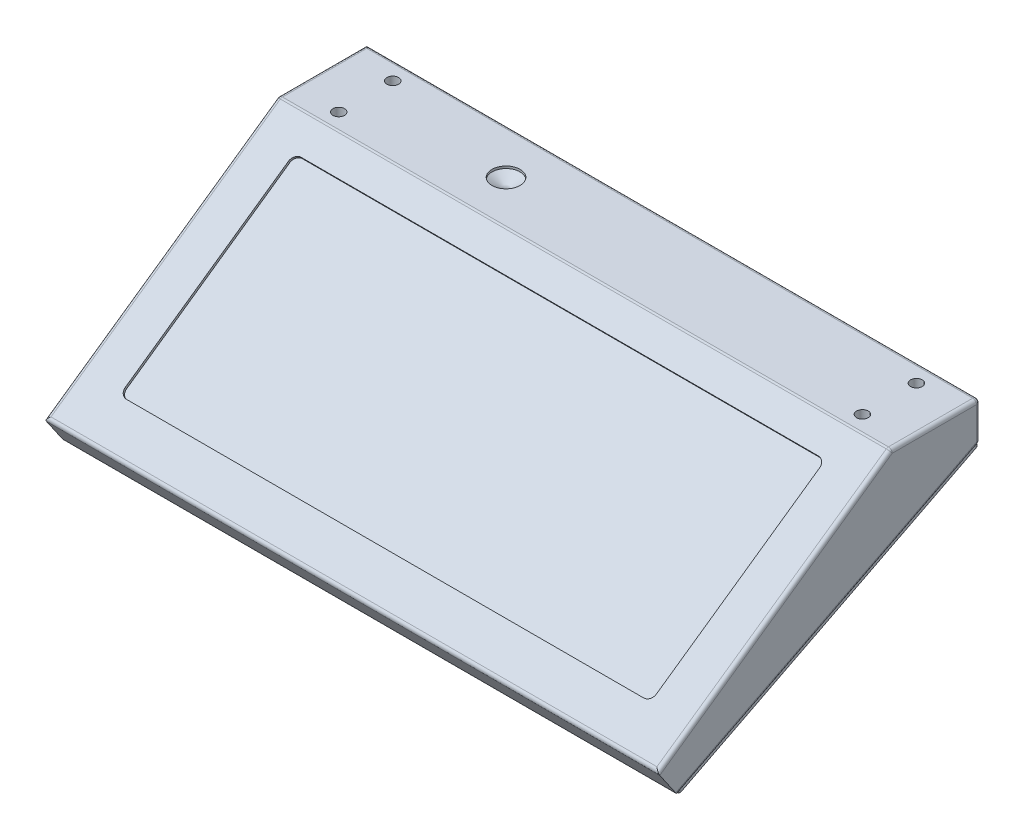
ISO-10303-21;
HEADER;
FILE_DESCRIPTION(('STEP AP214'),'2;1');
FILE_NAME('part.step','',(''),(''),'','','');
FILE_SCHEMA(('AUTOMOTIVE_DESIGN { 1 0 10303 214 1 1 1 1 }'));
ENDSEC;
DATA;
#1=APPLICATION_CONTEXT('core data for automotive mechanical design processes');
#2=APPLICATION_PROTOCOL_DEFINITION('international standard','automotive_design',2000,#1);
#3=PRODUCT_CONTEXT('',#1,'mechanical');
#4=PRODUCT('Part','Part','',(#3));
#5=PRODUCT_RELATED_PRODUCT_CATEGORY('part','',(#4));
#6=PRODUCT_DEFINITION_FORMATION('','',#4);
#7=PRODUCT_DEFINITION_CONTEXT('part definition',#1,'design');
#8=PRODUCT_DEFINITION('design','',#6,#7);
#9=PRODUCT_DEFINITION_SHAPE('','',#8);
#10=(LENGTH_UNIT() NAMED_UNIT(*) SI_UNIT(.MILLI.,.METRE.));
#11=(NAMED_UNIT(*) PLANE_ANGLE_UNIT() SI_UNIT($,.RADIAN.));
#12=(NAMED_UNIT(*) SI_UNIT($,.STERADIAN.) SOLID_ANGLE_UNIT());
#13=UNCERTAINTY_MEASURE_WITH_UNIT(LENGTH_MEASURE(1.E-05),#10,'distance_accuracy_value','');
#14=(GEOMETRIC_REPRESENTATION_CONTEXT(3) GLOBAL_UNCERTAINTY_ASSIGNED_CONTEXT((#13)) GLOBAL_UNIT_ASSIGNED_CONTEXT((#10,
#11,#12)) REPRESENTATION_CONTEXT('',''));
#15=CARTESIAN_POINT('',(0.,0.,0.));
#16=DIRECTION('',(0.,0.,1.));
#17=DIRECTION('',(1.,0.,0.));
#18=AXIS2_PLACEMENT_3D('',#15,#16,#17);
#19=CARTESIAN_POINT('',(208.28,0.,0.));
#20=DIRECTION('',(0.,0.,1.));
#21=DIRECTION('',(1.,0.,0.));
#22=AXIS2_PLACEMENT_3D('',#19,#20,#21);
#23=PLANE('',#22);
#24=DIRECTION('',(0.,1.,0.));
#25=VECTOR('',#24,1.);
#26=CARTESIAN_POINT('',(-208.28,0.,0.));
#27=LINE('',#26,#25);
#28=CARTESIAN_POINT('',(-208.28,-23.3112913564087,0.));
#29=VERTEX_POINT('',#28);
#30=CARTESIAN_POINT('',(-208.28,-2.54,0.));
#31=VERTEX_POINT('',#30);
#32=EDGE_CURVE('E394',#29,#31,#27,.T.);
#33=ORIENTED_EDGE('',*,*,#32,.T.);
#34=DIRECTION('',(-1.,0.,0.));
#35=VECTOR('',#34,1.);
#36=CARTESIAN_POINT('',(208.28,-2.54,0.));
#37=LINE('',#36,#35);
#38=CARTESIAN_POINT('',(205.74,-2.54,0.));
#39=VERTEX_POINT('',#38);
#40=EDGE_CURVE('E450',#31,#39,#37,.F.);
#41=ORIENTED_EDGE('',*,*,#40,.T.);
#42=DIRECTION('',(0.,1.,0.));
#43=VECTOR('',#42,1.);
#44=CARTESIAN_POINT('',(205.74,0.,0.));
#45=LINE('',#44,#43);
#46=CARTESIAN_POINT('',(205.74,-24.6054859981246,0.));
#47=VERTEX_POINT('',#46);
#48=EDGE_CURVE('E448',#39,#47,#45,.F.);
#49=ORIENTED_EDGE('',*,*,#48,.T.);
#50=DIRECTION('',(-1.,0.,0.));
#51=VECTOR('',#50,1.);
#52=CARTESIAN_POINT('',(208.28,-24.6054859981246,0.));
#53=LINE('',#52,#51);
#54=CARTESIAN_POINT('',(-208.003156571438,-24.6054859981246,0.));
#55=VERTEX_POINT('',#54);
#56=EDGE_CURVE('E444',#47,#55,#53,.T.);
#57=ORIENTED_EDGE('',*,*,#56,.T.);
#58=CARTESIAN_POINT('',(-205.74,-23.3112913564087,0.));
#59=DIRECTION('',(0.,0.,1.));
#60=DIRECTION('',(0.,-1.,0.));
#61=AXIS2_PLACEMENT_3D('',#58,#59,#60);
#62=ELLIPSE('',#61,2.85070864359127,2.54);
#63=EDGE_CURVE('E446',#55,#29,#62,.F.);
#64=ORIENTED_EDGE('',*,*,#63,.T.);
#65=EDGE_LOOP('',(#33,#41,#49,#57,#64));
#66=FACE_BOUND('',#65,.T.);
#67=ADVANCED_FACE('F33',(#66),#23,.F.);
#68=CARTESIAN_POINT('',(208.28,0.,0.));
#69=DIRECTION('',(0.,-1.,0.));
#70=DIRECTION('',(0.,0.,-1.));
#71=AXIS2_PLACEMENT_3D('',#68,#69,#70);
#72=PLANE('',#71);
#73=CARTESIAN_POINT('',(-82.55,0.,31.1590705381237));
#74=DIRECTION('',(0.,1.,0.));
#75=DIRECTION('',(0.,0.,1.));
#76=AXIS2_PLACEMENT_3D('',#73,#74,#75);
#77=CIRCLE('',#76,9.52500000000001);
#78=CARTESIAN_POINT('',(-82.55,0.,40.6840705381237));
#79=VERTEX_POINT('',#78);
#80=EDGE_CURVE('E247',#79,#79,#77,.T.);
#81=ORIENTED_EDGE('',*,*,#80,.F.);
#82=EDGE_LOOP('',(#81));
#83=FACE_BOUND('',#82,.T.);
#84=CARTESIAN_POINT('',(-177.8,0.,12.8202705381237));
#85=DIRECTION('',(0.,1.,0.));
#86=DIRECTION('',(0.,0.,1.));
#87=AXIS2_PLACEMENT_3D('',#84,#85,#86);
#88=CIRCLE('',#87,3.96874999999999);
#89=CARTESIAN_POINT('',(-177.8,0.,16.7890205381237));
#90=VERTEX_POINT('',#89);
#91=EDGE_CURVE('E246',#90,#90,#88,.T.);
#92=ORIENTED_EDGE('',*,*,#91,.F.);
#93=EDGE_LOOP('',(#92));
#94=FACE_BOUND('',#93,.T.);
#95=CARTESIAN_POINT('',(-177.8,0.,49.4978705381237));
#96=DIRECTION('',(0.,1.,0.));
#97=DIRECTION('',(0.,0.,1.));
#98=AXIS2_PLACEMENT_3D('',#95,#96,#97);
#99=CIRCLE('',#98,3.96874999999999);
#100=CARTESIAN_POINT('',(-177.8,0.,53.4666205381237));
#101=VERTEX_POINT('',#100);
#102=EDGE_CURVE('E254',#101,#101,#99,.T.);
#103=ORIENTED_EDGE('',*,*,#102,.F.);
#104=EDGE_LOOP('',(#103));
#105=FACE_BOUND('',#104,.T.);
#106=CARTESIAN_POINT('',(177.8,0.,49.4978705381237));
#107=DIRECTION('',(0.,1.,0.));
#108=DIRECTION('',(0.,0.,1.));
#109=AXIS2_PLACEMENT_3D('',#106,#107,#108);
#110=CIRCLE('',#109,3.96874999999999);
#111=CARTESIAN_POINT('',(177.8,0.,53.4666205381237));
#112=VERTEX_POINT('',#111);
#113=EDGE_CURVE('E260',#112,#112,#110,.T.);
#114=ORIENTED_EDGE('',*,*,#113,.F.);
#115=EDGE_LOOP('',(#114));
#116=FACE_BOUND('',#115,.T.);
#117=CARTESIAN_POINT('',(177.8,0.,12.8202705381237));
#118=DIRECTION('',(0.,1.,0.));
#119=DIRECTION('',(0.,0.,1.));
#120=AXIS2_PLACEMENT_3D('',#117,#118,#119);
#121=CIRCLE('',#120,3.96874999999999);
#122=CARTESIAN_POINT('',(177.8,0.,16.7890205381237));
#123=VERTEX_POINT('',#122);
#124=EDGE_CURVE('E264',#123,#123,#121,.T.);
#125=ORIENTED_EDGE('',*,*,#124,.F.);
#126=EDGE_LOOP('',(#125));
#127=FACE_BOUND('',#126,.T.);
#128=DIRECTION('',(0.,0.,1.));
#129=VECTOR('',#128,1.);
#130=CARTESIAN_POINT('',(-205.74,0.,60.579));
#131=LINE('',#130,#129);
#132=CARTESIAN_POINT('',(-205.74,0.,2.54));
#133=VERTEX_POINT('',#132);
#134=CARTESIAN_POINT('',(-205.74,0.,59.7781410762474));
#135=VERTEX_POINT('',#134);
#136=EDGE_CURVE('E412',#133,#135,#131,.T.);
#137=ORIENTED_EDGE('',*,*,#136,.T.);
#138=DIRECTION('',(-1.,0.,0.));
#139=VECTOR('',#138,1.);
#140=CARTESIAN_POINT('',(208.28,0.,59.7781410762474));
#141=LINE('',#140,#139);
#142=CARTESIAN_POINT('',(205.74,0.,59.7781410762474));
#143=VERTEX_POINT('',#142);
#144=EDGE_CURVE('E414',#135,#143,#141,.F.);
#145=ORIENTED_EDGE('',*,*,#144,.T.);
#146=DIRECTION('',(0.,0.,1.));
#147=VECTOR('',#146,1.);
#148=CARTESIAN_POINT('',(205.74,0.,0.));
#149=LINE('',#148,#147);
#150=CARTESIAN_POINT('',(205.74,0.,2.54));
#151=VERTEX_POINT('',#150);
#152=EDGE_CURVE('E408',#143,#151,#149,.F.);
#153=ORIENTED_EDGE('',*,*,#152,.T.);
#154=DIRECTION('',(-1.,0.,0.));
#155=VECTOR('',#154,1.);
#156=CARTESIAN_POINT('',(208.28,0.,2.54));
#157=LINE('',#156,#155);
#158=EDGE_CURVE('E410',#151,#133,#157,.T.);
#159=ORIENTED_EDGE('',*,*,#158,.T.);
#160=EDGE_LOOP('',(#137,#145,#153,#159));
#161=FACE_BOUND('',#160,.T.);
#162=ADVANCED_FACE('F603',(#83,#94,#105,#116,#127,#161),#72,.F.);
#163=CARTESIAN_POINT('',(208.28,0.,60.579));
#164=DIRECTION('',(0.,-0.819152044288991,-0.573576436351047));
#165=DIRECTION('',(0.,0.573576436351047,-0.819152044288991));
#166=AXIS2_PLACEMENT_3D('',#163,#164,#165);
#167=PLANE('',#166);
#168=DIRECTION('',(1.,0.,0.));
#169=VECTOR('',#168,1.);
#170=CARTESIAN_POINT('',(-175.5648,-94.7064068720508,195.833766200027));
#171=LINE('',#170,#169);
#172=CARTESIAN_POINT('',(-175.5648,-94.7064068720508,195.833766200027));
#173=VERTEX_POINT('',#172);
#174=CARTESIAN_POINT('',(175.5648,-94.7064068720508,195.833766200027));
#175=VERTEX_POINT('',#174);
#176=EDGE_CURVE('E353',#173,#175,#171,.T.);
#177=ORIENTED_EDGE('',*,*,#176,.F.);
#178=CARTESIAN_POINT('',(-175.5648,-91.9674646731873,191.922151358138));
#179=DIRECTION('',(0.,0.819152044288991,0.573576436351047));
#180=DIRECTION('',(0.,-0.573576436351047,0.819152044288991));
#181=AXIS2_PLACEMENT_3D('',#178,#179,#180);
#182=CIRCLE('',#181,4.77520000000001);
#183=CARTESIAN_POINT('',(-180.34,-91.9674646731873,191.922151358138));
#184=VERTEX_POINT('',#183);
#185=EDGE_CURVE('E50',#184,#173,#182,.T.);
#186=ORIENTED_EDGE('',*,*,#185,.F.);
#187=DIRECTION('',(0.,-0.573576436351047,0.819152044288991));
#188=VECTOR('',#187,1.);
#189=CARTESIAN_POINT('',(-180.34,-14.4029526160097,81.1485480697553));
#190=LINE('',#189,#188);
#191=CARTESIAN_POINT('',(-180.34,-14.4029526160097,81.1485480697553));
#192=VERTEX_POINT('',#191);
#193=EDGE_CURVE('E330',#192,#184,#190,.T.);
#194=ORIENTED_EDGE('',*,*,#193,.F.);
#195=CARTESIAN_POINT('',(-175.5648,-14.4029526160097,81.1485480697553));
#196=DIRECTION('',(0.,0.819152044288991,0.573576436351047));
#197=DIRECTION('',(0.,-0.573576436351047,0.819152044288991));
#198=AXIS2_PLACEMENT_3D('',#195,#196,#197);
#199=CIRCLE('',#198,4.7752);
#200=CARTESIAN_POINT('',(-175.5648,-11.6640104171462,77.2369332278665));
#201=VERTEX_POINT('',#200);
#202=EDGE_CURVE('E368',#201,#192,#199,.T.);
#203=ORIENTED_EDGE('',*,*,#202,.F.);
#204=DIRECTION('',(-1.,0.,0.));
#205=VECTOR('',#204,1.);
#206=CARTESIAN_POINT('',(-175.5648,-11.6640104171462,77.2369332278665));
#207=LINE('',#206,#205);
#208=CARTESIAN_POINT('',(175.5648,-11.6640104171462,77.2369332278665));
#209=VERTEX_POINT('',#208);
#210=EDGE_CURVE('E365',#209,#201,#207,.T.);
#211=ORIENTED_EDGE('',*,*,#210,.F.);
#212=CARTESIAN_POINT('',(175.5648,-14.4029526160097,81.1485480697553));
#213=DIRECTION('',(0.,0.819152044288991,0.573576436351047));
#214=DIRECTION('',(0.,0.573576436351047,-0.819152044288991));
#215=AXIS2_PLACEMENT_3D('',#212,#213,#214);
#216=CIRCLE('',#215,4.7752);
#217=CARTESIAN_POINT('',(180.34,-14.4029526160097,81.1485480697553));
#218=VERTEX_POINT('',#217);
#219=EDGE_CURVE('E362',#218,#209,#216,.T.);
#220=ORIENTED_EDGE('',*,*,#219,.F.);
#221=DIRECTION('',(0.,0.573576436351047,-0.819152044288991));
#222=VECTOR('',#221,1.);
#223=CARTESIAN_POINT('',(180.34,-14.4029526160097,81.1485480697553));
#224=LINE('',#223,#222);
#225=CARTESIAN_POINT('',(180.34,-91.9674646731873,191.922151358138));
#226=VERTEX_POINT('',#225);
#227=EDGE_CURVE('E359',#226,#218,#224,.T.);
#228=ORIENTED_EDGE('',*,*,#227,.F.);
#229=CARTESIAN_POINT('',(175.5648,-91.9674646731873,191.922151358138));
#230=DIRECTION('',(0.,0.819152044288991,0.573576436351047));
#231=DIRECTION('',(0.,-0.573576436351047,0.819152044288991));
#232=AXIS2_PLACEMENT_3D('',#229,#230,#231);
#233=CIRCLE('',#232,4.77520000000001);
#234=EDGE_CURVE('E356',#175,#226,#233,.T.);
#235=ORIENTED_EDGE('',*,*,#234,.F.);
#236=EDGE_LOOP('',(#177,#186,#194,#203,#211,#220,#228,#235));
#237=FACE_BOUND('',#236,.T.);
#238=DIRECTION('',(0.,-0.573576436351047,0.819152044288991));
#239=VECTOR('',#238,1.);
#240=CARTESIAN_POINT('',(205.74,0.,60.579));
#241=LINE('',#240,#239);
#242=CARTESIAN_POINT('',(205.74,-109.508377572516,216.973171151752));
#243=VERTEX_POINT('',#242);
#244=CARTESIAN_POINT('',(205.74,-0.459353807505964,61.235025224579));
#245=VERTEX_POINT('',#244);
#246=EDGE_CURVE('E403',#243,#245,#241,.F.);
#247=ORIENTED_EDGE('',*,*,#246,.T.);
#248=DIRECTION('',(-1.,0.,0.));
#249=VECTOR('',#248,1.);
#250=CARTESIAN_POINT('',(208.28,-0.459353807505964,61.235025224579));
#251=LINE('',#250,#249);
#252=CARTESIAN_POINT('',(-205.74,-0.459353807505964,61.235025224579));
#253=VERTEX_POINT('',#252);
#254=EDGE_CURVE('E405',#245,#253,#251,.T.);
#255=ORIENTED_EDGE('',*,*,#254,.T.);
#256=DIRECTION('',(0.,-0.573576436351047,0.819152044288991));
#257=VECTOR('',#256,1.);
#258=CARTESIAN_POINT('',(-205.74,-110.956296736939,219.041014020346));
#259=LINE('',#258,#257);
#260=CARTESIAN_POINT('',(-205.74,-109.508377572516,216.973171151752));
#261=VERTEX_POINT('',#260);
#262=EDGE_CURVE('E392',#253,#261,#259,.T.);
#263=ORIENTED_EDGE('',*,*,#262,.T.);
#264=DIRECTION('',(-1.,0.,0.));
#265=VECTOR('',#264,1.);
#266=CARTESIAN_POINT('',(208.28,-109.508377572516,216.973171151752));
#267=LINE('',#266,#265);
#268=EDGE_CURVE('E401',#261,#243,#267,.F.);
#269=ORIENTED_EDGE('',*,*,#268,.T.);
#270=EDGE_LOOP('',(#247,#255,#263,#269));
#271=FACE_BOUND('',#270,.T.);
#272=ADVANCED_FACE('F640',(#237,#271),#167,.F.);
#273=CARTESIAN_POINT('',(208.28,-110.956296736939,219.041014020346));
#274=DIRECTION('',(0.,0.568509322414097,-0.822676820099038));
#275=DIRECTION('',(0.,0.822676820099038,0.568509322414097));
#276=AXIS2_PLACEMENT_3D('',#273,#274,#275);
#277=PLANE('',#276);
#278=DIRECTION('',(0.,-0.822676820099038,-0.568509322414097));
#279=VECTOR('',#278,1.);
#280=CARTESIAN_POINT('',(208.28,-110.956296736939,219.041014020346));
#281=LINE('',#280,#279);
#282=CARTESIAN_POINT('',(208.28,-113.045935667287,217.596972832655));
#283=VERTEX_POINT('',#282);
#284=CARTESIAN_POINT('',(208.28,-128.678246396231,206.794292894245));
#285=VERTEX_POINT('',#284);
#286=EDGE_CURVE('E389',#283,#285,#281,.T.);
#287=ORIENTED_EDGE('',*,*,#286,.F.);
#288=CARTESIAN_POINT('',(205.74,-113.045935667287,217.596972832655));
#289=DIRECTION('',(0.,0.568509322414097,-0.822676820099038));
#290=DIRECTION('',(0.,-0.822676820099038,-0.568509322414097));
#291=AXIS2_PLACEMENT_3D('',#288,#289,#290);
#292=ELLIPSE('',#291,2.54004838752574,2.54);
#293=CARTESIAN_POINT('',(208.279951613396,-113.033037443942,217.605886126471));
#294=VERTEX_POINT('',#293);
#295=EDGE_CURVE('E436',#283,#294,#292,.F.);
#296=ORIENTED_EDGE('',*,*,#295,.T.);
#297=DIRECTION('',(-1.,0.,0.));
#298=VECTOR('',#297,1.);
#299=CARTESIAN_POINT('',(208.28,-113.033037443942,217.605886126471));
#300=LINE('',#299,#298);
#301=CARTESIAN_POINT('',(-208.279951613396,-113.033037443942,217.605886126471));
#302=VERTEX_POINT('',#301);
#303=EDGE_CURVE('E434',#294,#302,#300,.T.);
#304=ORIENTED_EDGE('',*,*,#303,.T.);
#305=CARTESIAN_POINT('',(-205.74,-113.045935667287,217.596972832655));
#306=DIRECTION('',(0.,0.568509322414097,-0.822676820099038));
#307=DIRECTION('',(0.,0.822676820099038,0.568509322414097));
#308=AXIS2_PLACEMENT_3D('',#305,#306,#307);
#309=ELLIPSE('',#308,2.54004838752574,2.54);
#310=CARTESIAN_POINT('',(-208.28,-113.045935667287,217.596972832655));
#311=VERTEX_POINT('',#310);
#312=EDGE_CURVE('E432',#302,#311,#309,.F.);
#313=ORIENTED_EDGE('',*,*,#312,.T.);
#314=DIRECTION('',(0.,-0.822676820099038,-0.568509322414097));
#315=VECTOR('',#314,1.);
#316=CARTESIAN_POINT('',(-208.28,-110.956296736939,219.041014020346));
#317=LINE('',#316,#315);
#318=CARTESIAN_POINT('',(-208.28,-128.678246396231,206.794292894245));
#319=VERTEX_POINT('',#318);
#320=EDGE_CURVE('E393',#311,#319,#317,.T.);
#321=ORIENTED_EDGE('',*,*,#320,.T.);
#322=CARTESIAN_POINT('',(-205.74,-128.678246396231,206.794292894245));
#323=DIRECTION('',(0.,0.568509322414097,-0.822676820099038));
#324=DIRECTION('',(0.,0.822676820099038,0.568509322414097));
#325=AXIS2_PLACEMENT_3D('',#322,#323,#324);
#326=ELLIPSE('',#325,2.56278767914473,2.54);
#327=CARTESIAN_POINT('',(-208.257414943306,-128.958778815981,206.600431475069));
#328=VERTEX_POINT('',#327);
#329=EDGE_CURVE('E430',#319,#328,#326,.F.);
#330=ORIENTED_EDGE('',*,*,#329,.T.);
#331=DIRECTION('',(-1.,0.,0.));
#332=VECTOR('',#331,1.);
#333=CARTESIAN_POINT('',(208.28,-128.958778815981,206.600431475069));
#334=LINE('',#333,#332);
#335=CARTESIAN_POINT('',(208.257414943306,-128.958778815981,206.600431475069));
#336=VERTEX_POINT('',#335);
#337=EDGE_CURVE('E428',#328,#336,#334,.F.);
#338=ORIENTED_EDGE('',*,*,#337,.T.);
#339=CARTESIAN_POINT('',(205.74,-128.678246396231,206.794292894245));
#340=DIRECTION('',(0.,0.568509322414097,-0.822676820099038));
#341=DIRECTION('',(0.,-0.822676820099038,-0.568509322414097));
#342=AXIS2_PLACEMENT_3D('',#339,#340,#341);
#343=ELLIPSE('',#342,2.56278767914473,2.54);
#344=EDGE_CURVE('E426',#336,#285,#343,.F.);
#345=ORIENTED_EDGE('',*,*,#344,.T.);
#346=EDGE_LOOP('',(#287,#296,#304,#313,#321,#330,#338,#345));
#347=FACE_BOUND('',#346,.T.);
#348=ADVANCED_FACE('F578',(#347),#277,.F.);
#349=CARTESIAN_POINT('',(208.28,0.,0.));
#350=DIRECTION('',(-1.,0.,0.));
#351=DIRECTION('',(0.,0.,1.));
#352=AXIS2_PLACEMENT_3D('',#349,#350,#351);
#353=PLANE('',#352);
#354=DIRECTION('',(0.,0.,1.));
#355=VECTOR('',#354,1.);
#356=CARTESIAN_POINT('',(208.28,-2.54,0.));
#357=LINE('',#356,#355);
#358=CARTESIAN_POINT('',(208.28,-2.54,2.54));
#359=VERTEX_POINT('',#358);
#360=CARTESIAN_POINT('',(208.28,-2.54,59.7781410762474));
#361=VERTEX_POINT('',#360);
#362=EDGE_CURVE('E421',#359,#361,#357,.T.);
#363=ORIENTED_EDGE('',*,*,#362,.T.);
#364=DIRECTION('',(0.,-0.573576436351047,0.819152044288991));
#365=VECTOR('',#364,1.);
#366=CARTESIAN_POINT('',(208.28,26.3821734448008,18.4729967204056));
#367=LINE('',#366,#365);
#368=EDGE_CURVE('E423',#361,#283,#367,.T.);
#369=ORIENTED_EDGE('',*,*,#368,.T.);
#370=ORIENTED_EDGE('',*,*,#286,.T.);
#371=DIRECTION('',(0.,0.453990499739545,-0.891006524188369));
#372=VECTOR('',#371,1.);
#373=CARTESIAN_POINT('',(208.28,-18.5066623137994,-9.42961543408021));
#374=LINE('',#373,#372);
#375=CARTESIAN_POINT('',(208.28,-24.6054859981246,2.54));
#376=VERTEX_POINT('',#375);
#377=EDGE_CURVE('E417',#285,#376,#374,.T.);
#378=ORIENTED_EDGE('',*,*,#377,.T.);
#379=DIRECTION('',(0.,1.,0.));
#380=VECTOR('',#379,1.);
#381=CARTESIAN_POINT('',(208.28,0.,2.54));
#382=LINE('',#381,#380);
#383=EDGE_CURVE('E419',#376,#359,#382,.T.);
#384=ORIENTED_EDGE('',*,*,#383,.T.);
#385=EDGE_LOOP('',(#363,#369,#370,#378,#384));
#386=FACE_BOUND('',#385,.T.);
#387=ADVANCED_FACE('F628',(#386),#353,.F.);
#388=CARTESIAN_POINT('',(-208.28,0.,0.));
#389=DIRECTION('',(-1.,0.,0.));
#390=DIRECTION('',(0.,0.,1.));
#391=AXIS2_PLACEMENT_3D('',#388,#389,#390);
#392=PLANE('',#391);
#393=ORIENTED_EDGE('',*,*,#320,.F.);
#394=DIRECTION('',(0.,-0.573576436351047,0.819152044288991));
#395=VECTOR('',#394,1.);
#396=CARTESIAN_POINT('',(-208.28,-2.08064619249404,59.1221158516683));
#397=LINE('',#396,#395);
#398=CARTESIAN_POINT('',(-208.28,-2.54,59.7781410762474));
#399=VERTEX_POINT('',#398);
#400=EDGE_CURVE('E442',#311,#399,#397,.F.);
#401=ORIENTED_EDGE('',*,*,#400,.T.);
#402=DIRECTION('',(0.,0.,1.));
#403=VECTOR('',#402,1.);
#404=CARTESIAN_POINT('',(-208.28,-2.54,0.));
#405=LINE('',#404,#403);
#406=EDGE_CURVE('E440',#399,#31,#405,.F.);
#407=ORIENTED_EDGE('',*,*,#406,.T.);
#408=ORIENTED_EDGE('',*,*,#32,.F.);
#409=DIRECTION('',(0.,0.453990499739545,-0.891006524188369));
#410=VECTOR('',#409,1.);
#411=CARTESIAN_POINT('',(-208.28,-128.52343584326,206.490460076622));
#412=LINE('',#411,#410);
#413=EDGE_CURVE('E438',#29,#319,#412,.F.);
#414=ORIENTED_EDGE('',*,*,#413,.T.);
#415=EDGE_LOOP('',(#393,#401,#407,#408,#414));
#416=FACE_BOUND('',#415,.T.);
#417=ADVANCED_FACE('F583',(#416),#392,.T.);
#418=CARTESIAN_POINT('',(-205.74,-23.8988434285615,1.15313586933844));
#419=DIRECTION('',(0.,-0.453990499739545,0.891006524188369));
#420=DIRECTION('',(0.,-0.891006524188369,-0.453990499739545));
#421=AXIS2_PLACEMENT_3D('',#418,#419,#420);
#422=CYLINDRICAL_SURFACE('',#421,2.54);
#423=CARTESIAN_POINT('',(-205.74,-24.6054859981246,2.54));
#424=DIRECTION('',(-0.707106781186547,-0.321019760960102,0.630036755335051));
#425=DIRECTION('',(-0.707106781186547,0.321019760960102,-0.630036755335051));
#426=AXIS2_PLACEMENT_3D('',#423,#424,#425);
#427=ELLIPSE('',#426,3.59210244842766,2.54);
#428=CARTESIAN_POINT('',(-205.74,-26.868642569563,1.38686413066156));
#429=VERTEX_POINT('',#428);
#430=EDGE_CURVE('E504',#429,#55,#427,.F.);
#431=ORIENTED_EDGE('',*,*,#430,.F.);
#432=DIRECTION('',(0.,0.453990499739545,-0.891006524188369));
#433=VECTOR('',#432,1.);
#434=CARTESIAN_POINT('',(-205.74,-26.162,0.));
#435=LINE('',#434,#433);
#436=CARTESIAN_POINT('',(-205.74,-129.777921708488,203.357696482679));
#437=VERTEX_POINT('',#436);
#438=EDGE_CURVE('E11',#437,#429,#435,.T.);
#439=ORIENTED_EDGE('',*,*,#438,.F.);
#440=CARTESIAN_POINT('',(-205.74,-127.514765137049,204.510832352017));
#441=DIRECTION('',(-0.707106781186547,0.321019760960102,-0.630036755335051));
#442=DIRECTION('',(-0.707106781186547,-0.321019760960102,0.630036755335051));
#443=AXIS2_PLACEMENT_3D('',#440,#441,#442);
#444=ELLIPSE('',#443,3.59210244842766,2.54);
#445=EDGE_CURVE('E397',#328,#437,#444,.F.);
#446=ORIENTED_EDGE('',*,*,#445,.F.);
#447=ORIENTED_EDGE('',*,*,#329,.F.);
#448=ORIENTED_EDGE('',*,*,#413,.F.);
#449=ORIENTED_EDGE('',*,*,#63,.F.);
#450=EDGE_LOOP('',(#431,#439,#446,#447,#448,#449));
#451=FACE_BOUND('',#450,.T.);
#452=ADVANCED_FACE('F35',(#451),#422,.T.);
#453=CARTESIAN_POINT('',(208.28,-127.514765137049,204.510832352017));
#454=DIRECTION('',(-1.,0.,0.));
#455=DIRECTION('',(0.,0.,1.));
#456=AXIS2_PLACEMENT_3D('',#453,#454,#455);
#457=CYLINDRICAL_SURFACE('',#456,2.54);
#458=ORIENTED_EDGE('',*,*,#445,.T.);
#459=DIRECTION('',(-1.,0.,0.));
#460=VECTOR('',#459,1.);
#461=CARTESIAN_POINT('',(208.28,-129.777921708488,203.357696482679));
#462=LINE('',#461,#460);
#463=CARTESIAN_POINT('',(205.74,-129.777921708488,203.357696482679));
#464=VERTEX_POINT('',#463);
#465=EDGE_CURVE('E42',#464,#437,#462,.T.);
#466=ORIENTED_EDGE('',*,*,#465,.F.);
#467=CARTESIAN_POINT('',(205.74,-127.514765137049,204.510832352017));
#468=DIRECTION('',(0.707106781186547,0.321019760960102,-0.630036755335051));
#469=DIRECTION('',(-0.707106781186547,0.321019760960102,-0.630036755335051));
#470=AXIS2_PLACEMENT_3D('',#467,#468,#469);
#471=ELLIPSE('',#470,3.59210244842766,2.54);
#472=EDGE_CURVE('E502',#336,#464,#471,.T.);
#473=ORIENTED_EDGE('',*,*,#472,.F.);
#474=ORIENTED_EDGE('',*,*,#337,.F.);
#475=EDGE_LOOP('',(#458,#466,#473,#474));
#476=FACE_BOUND('',#475,.T.);
#477=ADVANCED_FACE('F570',(#476),#457,.T.);
#478=CARTESIAN_POINT('',(208.28,-24.6054859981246,2.54));
#479=DIRECTION('',(-1.,0.,0.));
#480=DIRECTION('',(0.,0.,1.));
#481=AXIS2_PLACEMENT_3D('',#478,#479,#480);
#482=CYLINDRICAL_SURFACE('',#481,2.54);
#483=ORIENTED_EDGE('',*,*,#430,.T.);
#484=ORIENTED_EDGE('',*,*,#56,.F.);
#485=CARTESIAN_POINT('',(205.74,-24.6054859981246,2.54));
#486=DIRECTION('',(1.,0.,0.));
#487=DIRECTION('',(0.,0.,-1.));
#488=AXIS2_PLACEMENT_3D('',#485,#486,#487);
#489=CIRCLE('',#488,2.54);
#490=CARTESIAN_POINT('',(205.74,-26.868642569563,1.38686413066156));
#491=VERTEX_POINT('',#490);
#492=EDGE_CURVE('E499',#491,#47,#489,.T.);
#493=ORIENTED_EDGE('',*,*,#492,.F.);
#494=DIRECTION('',(-1.,0.,0.));
#495=VECTOR('',#494,1.);
#496=CARTESIAN_POINT('',(208.28,-26.868642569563,1.38686413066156));
#497=LINE('',#496,#495);
#498=EDGE_CURVE('E452',#429,#491,#497,.F.);
#499=ORIENTED_EDGE('',*,*,#498,.F.);
#500=EDGE_LOOP('',(#483,#484,#493,#499));
#501=FACE_BOUND('',#500,.T.);
#502=ADVANCED_FACE('F689',(#501),#482,.T.);
#503=CARTESIAN_POINT('',(205.74,-18.5066623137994,-9.42961543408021));
#504=DIRECTION('',(0.,0.453990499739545,-0.891006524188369));
#505=DIRECTION('',(0.,0.891006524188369,0.453990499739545));
#506=AXIS2_PLACEMENT_3D('',#503,#504,#505);
#507=CYLINDRICAL_SURFACE('',#506,2.54);
#508=ORIENTED_EDGE('',*,*,#472,.T.);
#509=DIRECTION('',(0.,0.453990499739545,-0.891006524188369));
#510=VECTOR('',#509,1.);
#511=CARTESIAN_POINT('',(205.74,-26.162,0.));
#512=LINE('',#511,#510);
#513=EDGE_CURVE('E455',#491,#464,#512,.F.);
#514=ORIENTED_EDGE('',*,*,#513,.F.);
#515=CARTESIAN_POINT('',(205.74,-24.6054859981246,2.54));
#516=DIRECTION('',(0.,0.453990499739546,-0.891006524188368));
#517=DIRECTION('',(0.,0.891006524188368,0.453990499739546));
#518=AXIS2_PLACEMENT_3D('',#515,#516,#517);
#519=CIRCLE('',#518,2.54);
#520=EDGE_CURVE('E496',#376,#491,#519,.T.);
#521=ORIENTED_EDGE('',*,*,#520,.F.);
#522=ORIENTED_EDGE('',*,*,#377,.F.);
#523=ORIENTED_EDGE('',*,*,#344,.F.);
#524=EDGE_LOOP('',(#508,#514,#521,#522,#523));
#525=FACE_BOUND('',#524,.T.);
#526=ADVANCED_FACE('F685',(#525),#507,.T.);
#527=CARTESIAN_POINT('',(205.74,-24.6054859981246,2.54));
#528=DIRECTION('',(0.,0.,1.));
#529=DIRECTION('',(1.,0.,0.));
#530=AXIS2_PLACEMENT_3D('',#527,#528,#529);
#531=SPHERICAL_SURFACE('',#530,2.54);
#532=ORIENTED_EDGE('',*,*,#520,.T.);
#533=ORIENTED_EDGE('',*,*,#492,.T.);
#534=CARTESIAN_POINT('',(205.74,-24.6054859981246,2.54));
#535=DIRECTION('',(0.,-1.,0.));
#536=DIRECTION('',(1.,0.,0.));
#537=AXIS2_PLACEMENT_3D('',#534,#535,#536);
#538=CIRCLE('',#537,2.54);
#539=EDGE_CURVE('E493',#376,#47,#538,.F.);
#540=ORIENTED_EDGE('',*,*,#539,.F.);
#541=EDGE_LOOP('',(#532,#533,#540));
#542=FACE_BOUND('',#541,.T.);
#543=ADVANCED_FACE('F682',(#542),#531,.T.);
#544=CARTESIAN_POINT('',(205.74,0.,2.54));
#545=DIRECTION('',(0.,1.,0.));
#546=DIRECTION('',(0.,0.,1.));
#547=AXIS2_PLACEMENT_3D('',#544,#545,#546);
#548=CYLINDRICAL_SURFACE('',#547,2.54);
#549=CARTESIAN_POINT('',(205.74,-2.54,2.54));
#550=DIRECTION('',(0.,1.,0.));
#551=DIRECTION('',(0.,0.,1.));
#552=AXIS2_PLACEMENT_3D('',#549,#550,#551);
#553=CIRCLE('',#552,2.54);
#554=EDGE_CURVE('E490',#359,#39,#553,.T.);
#555=ORIENTED_EDGE('',*,*,#554,.F.);
#556=ORIENTED_EDGE('',*,*,#383,.F.);
#557=ORIENTED_EDGE('',*,*,#539,.T.);
#558=ORIENTED_EDGE('',*,*,#48,.F.);
#559=EDGE_LOOP('',(#555,#556,#557,#558));
#560=FACE_BOUND('',#559,.T.);
#561=ADVANCED_FACE('F616',(#560),#548,.T.);
#562=CARTESIAN_POINT('',(205.74,-2.54,2.54));
#563=DIRECTION('',(0.,0.,1.));
#564=DIRECTION('',(1.,0.,0.));
#565=AXIS2_PLACEMENT_3D('',#562,#563,#564);
#566=SPHERICAL_SURFACE('',#565,2.54);
#567=CARTESIAN_POINT('',(205.74,-2.54,2.54));
#568=DIRECTION('',(0.,0.,-1.));
#569=DIRECTION('',(-1.,0.,0.));
#570=AXIS2_PLACEMENT_3D('',#567,#568,#569);
#571=CIRCLE('',#570,2.54);
#572=EDGE_CURVE('E484',#359,#151,#571,.F.);
#573=ORIENTED_EDGE('',*,*,#572,.F.);
#574=ORIENTED_EDGE('',*,*,#554,.T.);
#575=CARTESIAN_POINT('',(205.74,-2.54,2.54));
#576=DIRECTION('',(1.,0.,0.));
#577=DIRECTION('',(0.,0.,-1.));
#578=AXIS2_PLACEMENT_3D('',#575,#576,#577);
#579=CIRCLE('',#578,2.54);
#580=EDGE_CURVE('E487',#151,#39,#579,.F.);
#581=ORIENTED_EDGE('',*,*,#580,.F.);
#582=EDGE_LOOP('',(#573,#574,#581));
#583=FACE_BOUND('',#582,.T.);
#584=ADVANCED_FACE('F621',(#583),#566,.T.);
#585=CARTESIAN_POINT('',(208.28,-111.58902376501,215.51628700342));
#586=DIRECTION('',(-1.,0.,0.));
#587=DIRECTION('',(0.,0.,1.));
#588=AXIS2_PLACEMENT_3D('',#585,#586,#587);
#589=CYLINDRICAL_SURFACE('',#588,2.54);
#590=CARTESIAN_POINT('',(-205.74,-111.58902376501,215.51628700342));
#591=DIRECTION('',(-0.707106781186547,0.40557978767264,-0.579227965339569));
#592=DIRECTION('',(0.707106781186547,0.40557978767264,-0.579227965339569));
#593=AXIS2_PLACEMENT_3D('',#590,#591,#592);
#594=ELLIPSE('',#593,3.59210244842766,2.54);
#595=EDGE_CURVE('E478',#302,#261,#594,.T.);
#596=ORIENTED_EDGE('',*,*,#595,.F.);
#597=ORIENTED_EDGE('',*,*,#303,.F.);
#598=CARTESIAN_POINT('',(205.74,-111.58902376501,215.51628700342));
#599=DIRECTION('',(-0.707106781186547,-0.40557978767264,0.579227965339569));
#600=DIRECTION('',(-0.707106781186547,0.40557978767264,-0.579227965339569));
#601=AXIS2_PLACEMENT_3D('',#598,#599,#600);
#602=ELLIPSE('',#601,3.59210244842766,2.54);
#603=EDGE_CURVE('E481',#243,#294,#602,.F.);
#604=ORIENTED_EDGE('',*,*,#603,.F.);
#605=ORIENTED_EDGE('',*,*,#268,.F.);
#606=EDGE_LOOP('',(#596,#597,#604,#605));
#607=FACE_BOUND('',#606,.T.);
#608=ADVANCED_FACE('F637',(#607),#589,.T.);
#609=CARTESIAN_POINT('',(208.28,-2.54,2.54));
#610=DIRECTION('',(-1.,0.,0.));
#611=DIRECTION('',(0.,0.,1.));
#612=AXIS2_PLACEMENT_3D('',#609,#610,#611);
#613=CYLINDRICAL_SURFACE('',#612,2.54);
#614=ORIENTED_EDGE('',*,*,#580,.T.);
#615=ORIENTED_EDGE('',*,*,#40,.F.);
#616=CARTESIAN_POINT('',(-205.74,-2.54,2.54));
#617=DIRECTION('',(-0.707106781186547,0.,0.707106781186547));
#618=DIRECTION('',(-0.707106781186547,0.,-0.707106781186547));
#619=AXIS2_PLACEMENT_3D('',#616,#617,#618);
#620=ELLIPSE('',#619,3.59210244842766,2.54);
#621=EDGE_CURVE('E475',#133,#31,#620,.T.);
#622=ORIENTED_EDGE('',*,*,#621,.F.);
#623=ORIENTED_EDGE('',*,*,#158,.F.);
#624=EDGE_LOOP('',(#614,#615,#622,#623));
#625=FACE_BOUND('',#624,.T.);
#626=ADVANCED_FACE('F609',(#625),#613,.T.);
#627=CARTESIAN_POINT('',(205.74,-2.54,0.));
#628=DIRECTION('',(0.,0.,1.));
#629=DIRECTION('',(1.,0.,0.));
#630=AXIS2_PLACEMENT_3D('',#627,#628,#629);
#631=CYLINDRICAL_SURFACE('',#630,2.54);
#632=ORIENTED_EDGE('',*,*,#572,.T.);
#633=ORIENTED_EDGE('',*,*,#152,.F.);
#634=CARTESIAN_POINT('',(205.74,-2.54,59.7781410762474));
#635=DIRECTION('',(0.,0.,1.));
#636=DIRECTION('',(1.,0.,0.));
#637=AXIS2_PLACEMENT_3D('',#634,#635,#636);
#638=CIRCLE('',#637,2.54);
#639=EDGE_CURVE('E472',#361,#143,#638,.T.);
#640=ORIENTED_EDGE('',*,*,#639,.F.);
#641=ORIENTED_EDGE('',*,*,#362,.F.);
#642=EDGE_LOOP('',(#632,#633,#640,#641));
#643=FACE_BOUND('',#642,.T.);
#644=ADVANCED_FACE('F625',(#643),#631,.T.);
#645=CARTESIAN_POINT('',(205.74,26.3821734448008,18.4729967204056));
#646=DIRECTION('',(0.,-0.573576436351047,0.819152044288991));
#647=DIRECTION('',(0.,-0.819152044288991,-0.573576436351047));
#648=AXIS2_PLACEMENT_3D('',#645,#646,#647);
#649=CYLINDRICAL_SURFACE('',#648,2.54);
#650=ORIENTED_EDGE('',*,*,#295,.F.);
#651=ORIENTED_EDGE('',*,*,#368,.F.);
#652=CARTESIAN_POINT('',(205.74,-2.54,59.7781410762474));
#653=DIRECTION('',(0.,0.573576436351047,-0.819152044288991));
#654=DIRECTION('',(0.,0.819152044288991,0.573576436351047));
#655=AXIS2_PLACEMENT_3D('',#652,#653,#654);
#656=CIRCLE('',#655,2.54);
#657=EDGE_CURVE('E469',#245,#361,#656,.T.);
#658=ORIENTED_EDGE('',*,*,#657,.F.);
#659=ORIENTED_EDGE('',*,*,#246,.F.);
#660=ORIENTED_EDGE('',*,*,#603,.T.);
#661=EDGE_LOOP('',(#650,#651,#658,#659,#660));
#662=FACE_BOUND('',#661,.T.);
#663=ADVANCED_FACE('F631',(#662),#649,.T.);
#664=CARTESIAN_POINT('',(-205.74,-2.08064619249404,59.1221158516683));
#665=DIRECTION('',(0.,0.573576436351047,-0.819152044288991));
#666=DIRECTION('',(0.,0.819152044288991,0.573576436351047));
#667=AXIS2_PLACEMENT_3D('',#664,#665,#666);
#668=CYLINDRICAL_SURFACE('',#667,2.54);
#669=ORIENTED_EDGE('',*,*,#595,.T.);
#670=ORIENTED_EDGE('',*,*,#262,.F.);
#671=CARTESIAN_POINT('',(-205.74,-2.54,59.7781410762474));
#672=DIRECTION('',(0.,0.573576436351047,-0.819152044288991));
#673=DIRECTION('',(0.,0.819152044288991,0.573576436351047));
#674=AXIS2_PLACEMENT_3D('',#671,#672,#673);
#675=CIRCLE('',#674,2.54);
#676=EDGE_CURVE('E466',#399,#253,#675,.T.);
#677=ORIENTED_EDGE('',*,*,#676,.F.);
#678=ORIENTED_EDGE('',*,*,#400,.F.);
#679=ORIENTED_EDGE('',*,*,#312,.F.);
#680=EDGE_LOOP('',(#669,#670,#677,#678,#679));
#681=FACE_BOUND('',#680,.T.);
#682=ADVANCED_FACE('F588',(#681),#668,.T.);
#683=CARTESIAN_POINT('',(-205.74,-2.54,0.));
#684=DIRECTION('',(0.,0.,-1.));
#685=DIRECTION('',(-1.,0.,0.));
#686=AXIS2_PLACEMENT_3D('',#683,#684,#685);
#687=CYLINDRICAL_SURFACE('',#686,2.54);
#688=ORIENTED_EDGE('',*,*,#621,.T.);
#689=ORIENTED_EDGE('',*,*,#406,.F.);
#690=CARTESIAN_POINT('',(-205.74,-2.54,59.7781410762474));
#691=DIRECTION('',(0.,0.,1.));
#692=DIRECTION('',(1.,0.,0.));
#693=AXIS2_PLACEMENT_3D('',#690,#691,#692);
#694=CIRCLE('',#693,2.54);
#695=EDGE_CURVE('E463',#135,#399,#694,.T.);
#696=ORIENTED_EDGE('',*,*,#695,.F.);
#697=ORIENTED_EDGE('',*,*,#136,.F.);
#698=EDGE_LOOP('',(#688,#689,#696,#697));
#699=FACE_BOUND('',#698,.T.);
#700=ADVANCED_FACE('F597',(#699),#687,.T.);
#701=CARTESIAN_POINT('',(205.74,-2.54,59.7781410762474));
#702=DIRECTION('',(0.,0.,1.));
#703=DIRECTION('',(1.,0.,0.));
#704=AXIS2_PLACEMENT_3D('',#701,#702,#703);
#705=SPHERICAL_SURFACE('',#704,2.54);
#706=ORIENTED_EDGE('',*,*,#657,.T.);
#707=ORIENTED_EDGE('',*,*,#639,.T.);
#708=CARTESIAN_POINT('',(205.74,-2.54,59.7781410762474));
#709=DIRECTION('',(1.,0.,0.));
#710=DIRECTION('',(0.,0.,-1.));
#711=AXIS2_PLACEMENT_3D('',#708,#709,#710);
#712=CIRCLE('',#711,2.54);
#713=EDGE_CURVE('E461',#245,#143,#712,.F.);
#714=ORIENTED_EDGE('',*,*,#713,.F.);
#715=EDGE_LOOP('',(#706,#707,#714));
#716=FACE_BOUND('',#715,.T.);
#717=ADVANCED_FACE('F662',(#716),#705,.T.);
#718=CARTESIAN_POINT('',(-205.74,-2.54,59.7781410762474));
#719=DIRECTION('',(0.,0.,1.));
#720=DIRECTION('',(1.,0.,0.));
#721=AXIS2_PLACEMENT_3D('',#718,#719,#720);
#722=SPHERICAL_SURFACE('',#721,2.54);
#723=ORIENTED_EDGE('',*,*,#695,.T.);
#724=ORIENTED_EDGE('',*,*,#676,.T.);
#725=CARTESIAN_POINT('',(-205.74,-2.54,59.7781410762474));
#726=DIRECTION('',(-1.,0.,0.));
#727=DIRECTION('',(0.,0.,1.));
#728=AXIS2_PLACEMENT_3D('',#725,#726,#727);
#729=CIRCLE('',#728,2.54);
#730=EDGE_CURVE('E375',#135,#253,#729,.F.);
#731=ORIENTED_EDGE('',*,*,#730,.F.);
#732=EDGE_LOOP('',(#723,#724,#731));
#733=FACE_BOUND('',#732,.T.);
#734=ADVANCED_FACE('F593',(#733),#722,.T.);
#735=CARTESIAN_POINT('',(208.28,-2.54,59.7781410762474));
#736=DIRECTION('',(-1.,0.,0.));
#737=DIRECTION('',(0.,0.,1.));
#738=AXIS2_PLACEMENT_3D('',#735,#736,#737);
#739=CYLINDRICAL_SURFACE('',#738,2.54);
#740=ORIENTED_EDGE('',*,*,#713,.T.);
#741=ORIENTED_EDGE('',*,*,#144,.F.);
#742=ORIENTED_EDGE('',*,*,#730,.T.);
#743=ORIENTED_EDGE('',*,*,#254,.F.);
#744=EDGE_LOOP('',(#740,#741,#742,#743));
#745=FACE_BOUND('',#744,.T.);
#746=ADVANCED_FACE('F599',(#745),#739,.T.);
#747=CARTESIAN_POINT('',(-175.5648,-93.2782717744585,191.004314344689));
#748=DIRECTION('',(0.,0.819152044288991,0.573576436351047));
#749=DIRECTION('',(0.,-0.573576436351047,0.819152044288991));
#750=AXIS2_PLACEMENT_3D('',#747,#748,#749);
#751=CYLINDRICAL_SURFACE('',#750,4.77520000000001);
#752=ORIENTED_EDGE('',*,*,#185,.T.);
#753=DIRECTION('',(0.,0.819152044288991,0.573576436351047));
#754=VECTOR('',#753,1.);
#755=CARTESIAN_POINT('',(-175.5648,-96.017213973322,194.915929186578));
#756=LINE('',#755,#754);
#757=CARTESIAN_POINT('',(-175.5648,-96.017213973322,194.915929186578));
#758=VERTEX_POINT('',#757);
#759=EDGE_CURVE('E351',#758,#173,#756,.T.);
#760=ORIENTED_EDGE('',*,*,#759,.F.);
#761=CARTESIAN_POINT('',(-175.5648,-93.2782717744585,191.004314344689));
#762=DIRECTION('',(0.,0.819152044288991,0.573576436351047));
#763=DIRECTION('',(0.,-0.573576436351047,0.819152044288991));
#764=AXIS2_PLACEMENT_3D('',#761,#762,#763);
#765=CIRCLE('',#764,4.77520000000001);
#766=CARTESIAN_POINT('',(-180.34,-93.2782717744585,191.004314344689));
#767=VERTEX_POINT('',#766);
#768=EDGE_CURVE('E326',#767,#758,#765,.T.);
#769=ORIENTED_EDGE('',*,*,#768,.F.);
#770=DIRECTION('',(0.,0.819152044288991,0.573576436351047));
#771=VECTOR('',#770,1.);
#772=CARTESIAN_POINT('',(-180.34,-93.2782717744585,191.004314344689));
#773=LINE('',#772,#771);
#774=EDGE_CURVE('E373',#767,#184,#773,.T.);
#775=ORIENTED_EDGE('',*,*,#774,.T.);
#776=EDGE_LOOP('',(#752,#760,#769,#775));
#777=FACE_BOUND('',#776,.T.);
#778=ADVANCED_FACE('F659',(#777),#751,.F.);
#779=CARTESIAN_POINT('',(-180.34,-15.7137597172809,80.2307110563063));
#780=DIRECTION('',(-1.,0.,0.));
#781=DIRECTION('',(0.,0.,1.));
#782=AXIS2_PLACEMENT_3D('',#779,#780,#781);
#783=PLANE('',#782);
#784=ORIENTED_EDGE('',*,*,#193,.T.);
#785=ORIENTED_EDGE('',*,*,#774,.F.);
#786=DIRECTION('',(0.,-0.573576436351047,0.819152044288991));
#787=VECTOR('',#786,1.);
#788=CARTESIAN_POINT('',(-180.34,-15.7137597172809,80.2307110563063));
#789=LINE('',#788,#787);
#790=CARTESIAN_POINT('',(-180.34,-15.7137597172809,80.2307110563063));
#791=VERTEX_POINT('',#790);
#792=EDGE_CURVE('E348',#791,#767,#789,.T.);
#793=ORIENTED_EDGE('',*,*,#792,.F.);
#794=DIRECTION('',(0.,0.819152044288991,0.573576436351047));
#795=VECTOR('',#794,1.);
#796=CARTESIAN_POINT('',(-180.34,-15.7137597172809,80.2307110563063));
#797=LINE('',#796,#795);
#798=EDGE_CURVE('E376',#791,#192,#797,.T.);
#799=ORIENTED_EDGE('',*,*,#798,.T.);
#800=EDGE_LOOP('',(#784,#785,#793,#799));
#801=FACE_BOUND('',#800,.T.);
#802=ADVANCED_FACE('F708',(#801),#783,.F.);
#803=CARTESIAN_POINT('',(-175.5648,-15.7137597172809,80.2307110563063));
#804=DIRECTION('',(0.,0.819152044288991,0.573576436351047));
#805=DIRECTION('',(0.,-0.573576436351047,0.819152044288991));
#806=AXIS2_PLACEMENT_3D('',#803,#804,#805);
#807=CYLINDRICAL_SURFACE('',#806,4.7752);
#808=ORIENTED_EDGE('',*,*,#202,.T.);
#809=ORIENTED_EDGE('',*,*,#798,.F.);
#810=CARTESIAN_POINT('',(-175.5648,-15.7137597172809,80.2307110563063));
#811=DIRECTION('',(0.,0.819152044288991,0.573576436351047));
#812=DIRECTION('',(0.,-0.573576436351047,0.819152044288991));
#813=AXIS2_PLACEMENT_3D('',#810,#811,#812);
#814=CIRCLE('',#813,4.7752);
#815=CARTESIAN_POINT('',(-175.5648,-12.9748175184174,76.3190962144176));
#816=VERTEX_POINT('',#815);
#817=EDGE_CURVE('E345',#816,#791,#814,.T.);
#818=ORIENTED_EDGE('',*,*,#817,.F.);
#819=DIRECTION('',(0.,0.819152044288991,0.573576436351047));
#820=VECTOR('',#819,1.);
#821=CARTESIAN_POINT('',(-175.5648,-12.9748175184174,76.3190962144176));
#822=LINE('',#821,#820);
#823=EDGE_CURVE('E378',#816,#201,#822,.T.);
#824=ORIENTED_EDGE('',*,*,#823,.T.);
#825=EDGE_LOOP('',(#808,#809,#818,#824));
#826=FACE_BOUND('',#825,.T.);
#827=ADVANCED_FACE('F728',(#826),#807,.F.);
#828=CARTESIAN_POINT('',(-175.5648,-12.9748175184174,76.3190962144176));
#829=DIRECTION('',(0.,0.573576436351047,-0.819152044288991));
#830=DIRECTION('',(0.,0.819152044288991,0.573576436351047));
#831=AXIS2_PLACEMENT_3D('',#828,#829,#830);
#832=PLANE('',#831);
#833=ORIENTED_EDGE('',*,*,#210,.T.);
#834=ORIENTED_EDGE('',*,*,#823,.F.);
#835=DIRECTION('',(-1.,0.,0.));
#836=VECTOR('',#835,1.);
#837=CARTESIAN_POINT('',(-175.5648,-12.9748175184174,76.3190962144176));
#838=LINE('',#837,#836);
#839=CARTESIAN_POINT('',(175.5648,-12.9748175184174,76.3190962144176));
#840=VERTEX_POINT('',#839);
#841=EDGE_CURVE('E342',#840,#816,#838,.T.);
#842=ORIENTED_EDGE('',*,*,#841,.F.);
#843=DIRECTION('',(0.,0.819152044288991,0.573576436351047));
#844=VECTOR('',#843,1.);
#845=CARTESIAN_POINT('',(175.5648,-12.9748175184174,76.3190962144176));
#846=LINE('',#845,#844);
#847=EDGE_CURVE('E380',#840,#209,#846,.T.);
#848=ORIENTED_EDGE('',*,*,#847,.T.);
#849=EDGE_LOOP('',(#833,#834,#842,#848));
#850=FACE_BOUND('',#849,.T.);
#851=ADVANCED_FACE('F724',(#850),#832,.F.);
#852=CARTESIAN_POINT('',(175.5648,-15.7137597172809,80.2307110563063));
#853=DIRECTION('',(0.,0.819152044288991,0.573576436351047));
#854=DIRECTION('',(0.,-0.573576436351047,0.819152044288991));
#855=AXIS2_PLACEMENT_3D('',#852,#853,#854);
#856=CYLINDRICAL_SURFACE('',#855,4.7752);
#857=ORIENTED_EDGE('',*,*,#219,.T.);
#858=ORIENTED_EDGE('',*,*,#847,.F.);
#859=CARTESIAN_POINT('',(175.5648,-15.7137597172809,80.2307110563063));
#860=DIRECTION('',(0.,0.819152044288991,0.573576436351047));
#861=DIRECTION('',(0.,0.573576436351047,-0.819152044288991));
#862=AXIS2_PLACEMENT_3D('',#859,#860,#861);
#863=CIRCLE('',#862,4.7752);
#864=CARTESIAN_POINT('',(180.34,-15.7137597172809,80.2307110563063));
#865=VERTEX_POINT('',#864);
#866=EDGE_CURVE('E339',#865,#840,#863,.T.);
#867=ORIENTED_EDGE('',*,*,#866,.F.);
#868=DIRECTION('',(0.,0.819152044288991,0.573576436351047));
#869=VECTOR('',#868,1.);
#870=CARTESIAN_POINT('',(180.34,-15.7137597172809,80.2307110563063));
#871=LINE('',#870,#869);
#872=EDGE_CURVE('E382',#865,#218,#871,.T.);
#873=ORIENTED_EDGE('',*,*,#872,.T.);
#874=EDGE_LOOP('',(#857,#858,#867,#873));
#875=FACE_BOUND('',#874,.T.);
#876=ADVANCED_FACE('F720',(#875),#856,.F.);
#877=CARTESIAN_POINT('',(180.34,-15.7137597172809,80.2307110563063));
#878=DIRECTION('',(1.,0.,0.));
#879=DIRECTION('',(0.,0.,-1.));
#880=AXIS2_PLACEMENT_3D('',#877,#878,#879);
#881=PLANE('',#880);
#882=ORIENTED_EDGE('',*,*,#227,.T.);
#883=ORIENTED_EDGE('',*,*,#872,.F.);
#884=DIRECTION('',(0.,0.573576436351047,-0.819152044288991));
#885=VECTOR('',#884,1.);
#886=CARTESIAN_POINT('',(180.34,-15.7137597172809,80.2307110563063));
#887=LINE('',#886,#885);
#888=CARTESIAN_POINT('',(180.34,-93.2782717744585,191.004314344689));
#889=VERTEX_POINT('',#888);
#890=EDGE_CURVE('E336',#889,#865,#887,.T.);
#891=ORIENTED_EDGE('',*,*,#890,.F.);
#892=DIRECTION('',(0.,0.819152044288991,0.573576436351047));
#893=VECTOR('',#892,1.);
#894=CARTESIAN_POINT('',(180.34,-93.2782717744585,191.004314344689));
#895=LINE('',#894,#893);
#896=EDGE_CURVE('E384',#889,#226,#895,.T.);
#897=ORIENTED_EDGE('',*,*,#896,.T.);
#898=EDGE_LOOP('',(#882,#883,#891,#897));
#899=FACE_BOUND('',#898,.T.);
#900=ADVANCED_FACE('F716',(#899),#881,.F.);
#901=CARTESIAN_POINT('',(175.5648,-93.2782717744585,191.004314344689));
#902=DIRECTION('',(0.,0.819152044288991,0.573576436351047));
#903=DIRECTION('',(0.,-0.573576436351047,0.819152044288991));
#904=AXIS2_PLACEMENT_3D('',#901,#902,#903);
#905=CYLINDRICAL_SURFACE('',#904,4.77520000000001);
#906=ORIENTED_EDGE('',*,*,#234,.T.);
#907=ORIENTED_EDGE('',*,*,#896,.F.);
#908=CARTESIAN_POINT('',(175.5648,-93.2782717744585,191.004314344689));
#909=DIRECTION('',(0.,0.819152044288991,0.573576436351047));
#910=DIRECTION('',(0.,-0.573576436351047,0.819152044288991));
#911=AXIS2_PLACEMENT_3D('',#908,#909,#910);
#912=CIRCLE('',#911,4.77520000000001);
#913=CARTESIAN_POINT('',(175.5648,-96.017213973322,194.915929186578));
#914=VERTEX_POINT('',#913);
#915=EDGE_CURVE('E333',#914,#889,#912,.T.);
#916=ORIENTED_EDGE('',*,*,#915,.F.);
#917=DIRECTION('',(0.,0.819152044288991,0.573576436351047));
#918=VECTOR('',#917,1.);
#919=CARTESIAN_POINT('',(175.5648,-96.017213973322,194.915929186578));
#920=LINE('',#919,#918);
#921=EDGE_CURVE('E386',#914,#175,#920,.T.);
#922=ORIENTED_EDGE('',*,*,#921,.T.);
#923=EDGE_LOOP('',(#906,#907,#916,#922));
#924=FACE_BOUND('',#923,.T.);
#925=ADVANCED_FACE('F712',(#924),#905,.F.);
#926=CARTESIAN_POINT('',(-175.5648,-96.017213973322,194.915929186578));
#927=DIRECTION('',(0.,-0.573576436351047,0.819152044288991));
#928=DIRECTION('',(0.,-0.819152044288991,-0.573576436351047));
#929=AXIS2_PLACEMENT_3D('',#926,#927,#928);
#930=PLANE('',#929);
#931=ORIENTED_EDGE('',*,*,#176,.T.);
#932=ORIENTED_EDGE('',*,*,#921,.F.);
#933=DIRECTION('',(1.,0.,0.));
#934=VECTOR('',#933,1.);
#935=CARTESIAN_POINT('',(-175.5648,-96.017213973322,194.915929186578));
#936=LINE('',#935,#934);
#937=EDGE_CURVE('E329',#758,#914,#936,.T.);
#938=ORIENTED_EDGE('',*,*,#937,.F.);
#939=ORIENTED_EDGE('',*,*,#759,.T.);
#940=EDGE_LOOP('',(#931,#932,#938,#939));
#941=FACE_BOUND('',#940,.T.);
#942=ADVANCED_FACE('F709',(#941),#930,.F.);
#943=CARTESIAN_POINT('',(-175.5648,-93.2782717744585,191.004314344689));
#944=DIRECTION('',(0.,0.819152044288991,0.573576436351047));
#945=DIRECTION('',(0.,-0.573576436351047,0.819152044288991));
#946=AXIS2_PLACEMENT_3D('',#943,#944,#945);
#947=PLANE('',#946);
#948=ORIENTED_EDGE('',*,*,#768,.T.);
#949=ORIENTED_EDGE('',*,*,#937,.T.);
#950=ORIENTED_EDGE('',*,*,#915,.T.);
#951=ORIENTED_EDGE('',*,*,#890,.T.);
#952=ORIENTED_EDGE('',*,*,#866,.T.);
#953=ORIENTED_EDGE('',*,*,#841,.T.);
#954=ORIENTED_EDGE('',*,*,#817,.T.);
#955=ORIENTED_EDGE('',*,*,#792,.T.);
#956=EDGE_LOOP('',(#948,#949,#950,#951,#952,#953,#954,#955));
#957=FACE_BOUND('',#956,.T.);
#958=ADVANCED_FACE('F565',(#957),#947,.T.);
#959=CARTESIAN_POINT('',(-205.232,-27.2028348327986,2.04275337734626));
#960=DIRECTION('',(0.,-0.891006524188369,-0.453990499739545));
#961=DIRECTION('',(0.,0.453990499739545,-0.891006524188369));
#962=AXIS2_PLACEMENT_3D('',#959,#960,#961);
#963=PLANE('',#962);
#964=CARTESIAN_POINT('',(-205.232,-27.2028348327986,2.04275337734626));
#965=DIRECTION('',(0.,-0.891006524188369,-0.453990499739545));
#966=DIRECTION('',(0.,0.453990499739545,-0.891006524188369));
#967=AXIS2_PLACEMENT_3D('',#964,#965,#966);
#968=CIRCLE('',#967,1.52400000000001);
#969=CARTESIAN_POINT('',(-206.756,-27.2028348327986,2.04275337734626));
#970=VERTEX_POINT('',#969);
#971=CARTESIAN_POINT('',(-205.232,-26.5109533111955,0.684859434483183));
#972=VERTEX_POINT('',#971);
#973=EDGE_CURVE('E287',#970,#972,#968,.T.);
#974=ORIENTED_EDGE('',*,*,#973,.F.);
#975=DIRECTION('',(0.,0.453990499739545,-0.891006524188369));
#976=VECTOR('',#975,1.);
#977=CARTESIAN_POINT('',(-206.756,-129.313016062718,202.445267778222));
#978=LINE('',#977,#976);
#979=CARTESIAN_POINT('',(-206.756,-129.313016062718,202.445267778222));
#980=VERTEX_POINT('',#979);
#981=EDGE_CURVE('E272',#980,#970,#978,.T.);
#982=ORIENTED_EDGE('',*,*,#981,.F.);
#983=CARTESIAN_POINT('',(-205.232,-129.313016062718,202.445267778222));
#984=DIRECTION('',(0.,-0.891006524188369,-0.453990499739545));
#985=DIRECTION('',(0.,0.453990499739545,-0.891006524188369));
#986=AXIS2_PLACEMENT_3D('',#983,#984,#985);
#987=CIRCLE('',#986,1.524);
#988=CARTESIAN_POINT('',(-205.232,-130.004897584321,203.803161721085));
#989=VERTEX_POINT('',#988);
#990=EDGE_CURVE('E300',#989,#980,#987,.T.);
#991=ORIENTED_EDGE('',*,*,#990,.F.);
#992=DIRECTION('',(-1.,0.,0.));
#993=VECTOR('',#992,1.);
#994=CARTESIAN_POINT('',(-205.232,-130.004897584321,203.803161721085));
#995=LINE('',#994,#993);
#996=CARTESIAN_POINT('',(205.232,-130.004897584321,203.803161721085));
#997=VERTEX_POINT('',#996);
#998=EDGE_CURVE('E298',#997,#989,#995,.T.);
#999=ORIENTED_EDGE('',*,*,#998,.F.);
#1000=CARTESIAN_POINT('',(205.232,-129.313016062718,202.445267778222));
#1001=DIRECTION('',(0.,-0.891006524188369,-0.453990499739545));
#1002=DIRECTION('',(0.,-0.453990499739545,0.891006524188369));
#1003=AXIS2_PLACEMENT_3D('',#1000,#1001,#1002);
#1004=CIRCLE('',#1003,1.524);
#1005=CARTESIAN_POINT('',(206.756,-129.313016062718,202.445267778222));
#1006=VERTEX_POINT('',#1005);
#1007=EDGE_CURVE('E296',#1006,#997,#1004,.T.);
#1008=ORIENTED_EDGE('',*,*,#1007,.F.);
#1009=DIRECTION('',(0.,-0.453990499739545,0.891006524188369));
#1010=VECTOR('',#1009,1.);
#1011=CARTESIAN_POINT('',(206.756,-129.313016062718,202.445267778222));
#1012=LINE('',#1011,#1010);
#1013=CARTESIAN_POINT('',(206.756,-27.2028348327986,2.04275337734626));
#1014=VERTEX_POINT('',#1013);
#1015=EDGE_CURVE('E294',#1014,#1006,#1012,.T.);
#1016=ORIENTED_EDGE('',*,*,#1015,.F.);
#1017=CARTESIAN_POINT('',(205.232,-27.2028348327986,2.04275337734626));
#1018=DIRECTION('',(0.,-0.891006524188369,-0.453990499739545));
#1019=DIRECTION('',(0.,0.453990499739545,-0.891006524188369));
#1020=AXIS2_PLACEMENT_3D('',#1017,#1018,#1019);
#1021=CIRCLE('',#1020,1.52400000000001);
#1022=CARTESIAN_POINT('',(205.232,-26.5109533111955,0.684859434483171));
#1023=VERTEX_POINT('',#1022);
#1024=EDGE_CURVE('E292',#1023,#1014,#1021,.T.);
#1025=ORIENTED_EDGE('',*,*,#1024,.F.);
#1026=DIRECTION('',(1.,0.,0.));
#1027=VECTOR('',#1026,1.);
#1028=CARTESIAN_POINT('',(-205.232,-26.5109533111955,0.684859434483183));
#1029=LINE('',#1028,#1027);
#1030=EDGE_CURVE('E290',#972,#1023,#1029,.T.);
#1031=ORIENTED_EDGE('',*,*,#1030,.F.);
#1032=EDGE_LOOP('',(#974,#982,#991,#999,#1008,#1016,#1025,#1031));
#1033=FACE_BOUND('',#1032,.T.);
#1034=ORIENTED_EDGE('',*,*,#465,.T.);
#1035=ORIENTED_EDGE('',*,*,#438,.T.);
#1036=ORIENTED_EDGE('',*,*,#498,.T.);
#1037=ORIENTED_EDGE('',*,*,#513,.T.);
#1038=EDGE_LOOP('',(#1034,#1035,#1036,#1037));
#1039=FACE_BOUND('',#1038,.T.);
#1040=ADVANCED_FACE('F562',(#1033,#1039),#963,.F.);
#1041=CARTESIAN_POINT('',(-205.232,-29.2396757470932,1.00493109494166));
#1042=DIRECTION('',(0.,0.891006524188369,0.453990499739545));
#1043=DIRECTION('',(0.,-0.453990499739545,0.891006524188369));
#1044=AXIS2_PLACEMENT_3D('',#1041,#1042,#1043);
#1045=CYLINDRICAL_SURFACE('',#1044,1.52400000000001);
#1046=ORIENTED_EDGE('',*,*,#973,.T.);
#1047=DIRECTION('',(0.,0.891006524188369,0.453990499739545));
#1048=VECTOR('',#1047,1.);
#1049=CARTESIAN_POINT('',(-205.232,-28.5477942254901,-0.352962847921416));
#1050=LINE('',#1049,#1048);
#1051=CARTESIAN_POINT('',(-205.232,-28.5477942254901,-0.352962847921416));
#1052=VERTEX_POINT('',#1051);
#1053=EDGE_CURVE('E323',#1052,#972,#1050,.T.);
#1054=ORIENTED_EDGE('',*,*,#1053,.F.);
#1055=CARTESIAN_POINT('',(-205.232,-29.2396757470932,1.00493109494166));
#1056=DIRECTION('',(0.,-0.891006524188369,-0.453990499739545));
#1057=DIRECTION('',(0.,0.453990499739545,-0.891006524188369));
#1058=AXIS2_PLACEMENT_3D('',#1055,#1056,#1057);
#1059=CIRCLE('',#1058,1.52400000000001);
#1060=CARTESIAN_POINT('',(-206.756,-29.2396757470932,1.00493109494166));
#1061=VERTEX_POINT('',#1060);
#1062=EDGE_CURVE('E268',#1061,#1052,#1059,.T.);
#1063=ORIENTED_EDGE('',*,*,#1062,.F.);
#1064=DIRECTION('',(0.,0.891006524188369,0.453990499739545));
#1065=VECTOR('',#1064,1.);
#1066=CARTESIAN_POINT('',(-206.756,-29.2396757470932,1.00493109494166));
#1067=LINE('',#1066,#1065);
#1068=EDGE_CURVE('E286',#1061,#970,#1067,.T.);
#1069=ORIENTED_EDGE('',*,*,#1068,.T.);
#1070=EDGE_LOOP('',(#1046,#1054,#1063,#1069));
#1071=FACE_BOUND('',#1070,.T.);
#1072=ADVANCED_FACE('F530',(#1071),#1045,.T.);
#1073=CARTESIAN_POINT('',(-205.232,-28.5477942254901,-0.352962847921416));
#1074=DIRECTION('',(0.,-0.453990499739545,0.891006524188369));
#1075=DIRECTION('',(0.,-0.891006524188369,-0.453990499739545));
#1076=AXIS2_PLACEMENT_3D('',#1073,#1074,#1075);
#1077=PLANE('',#1076);
#1078=ORIENTED_EDGE('',*,*,#1030,.T.);
#1079=DIRECTION('',(0.,0.891006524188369,0.453990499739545));
#1080=VECTOR('',#1079,1.);
#1081=CARTESIAN_POINT('',(205.232,-28.5477942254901,-0.352962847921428));
#1082=LINE('',#1081,#1080);
#1083=CARTESIAN_POINT('',(205.232,-28.5477942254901,-0.352962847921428));
#1084=VERTEX_POINT('',#1083);
#1085=EDGE_CURVE('E320',#1084,#1023,#1082,.T.);
#1086=ORIENTED_EDGE('',*,*,#1085,.F.);
#1087=DIRECTION('',(1.,0.,0.));
#1088=VECTOR('',#1087,1.);
#1089=CARTESIAN_POINT('',(-205.232,-28.5477942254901,-0.352962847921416));
#1090=LINE('',#1089,#1088);
#1091=EDGE_CURVE('E271',#1052,#1084,#1090,.T.);
#1092=ORIENTED_EDGE('',*,*,#1091,.F.);
#1093=ORIENTED_EDGE('',*,*,#1053,.T.);
#1094=EDGE_LOOP('',(#1078,#1086,#1092,#1093));
#1095=FACE_BOUND('',#1094,.T.);
#1096=ADVANCED_FACE('F533',(#1095),#1077,.F.);
#1097=CARTESIAN_POINT('',(205.232,-29.2396757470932,1.00493109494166));
#1098=DIRECTION('',(0.,0.891006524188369,0.453990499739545));
#1099=DIRECTION('',(0.,-0.453990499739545,0.891006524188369));
#1100=AXIS2_PLACEMENT_3D('',#1097,#1098,#1099);
#1101=CYLINDRICAL_SURFACE('',#1100,1.52400000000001);
#1102=ORIENTED_EDGE('',*,*,#1024,.T.);
#1103=DIRECTION('',(0.,0.891006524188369,0.453990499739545));
#1104=VECTOR('',#1103,1.);
#1105=CARTESIAN_POINT('',(206.756,-29.2396757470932,1.00493109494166));
#1106=LINE('',#1105,#1104);
#1107=CARTESIAN_POINT('',(206.756,-29.2396757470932,1.00493109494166));
#1108=VERTEX_POINT('',#1107);
#1109=EDGE_CURVE('E317',#1108,#1014,#1106,.T.);
#1110=ORIENTED_EDGE('',*,*,#1109,.F.);
#1111=CARTESIAN_POINT('',(205.232,-29.2396757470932,1.00493109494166));
#1112=DIRECTION('',(0.,-0.891006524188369,-0.453990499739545));
#1113=DIRECTION('',(0.,0.453990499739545,-0.891006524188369));
#1114=AXIS2_PLACEMENT_3D('',#1111,#1112,#1113);
#1115=CIRCLE('',#1114,1.52400000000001);
#1116=EDGE_CURVE('E274',#1084,#1108,#1115,.T.);
#1117=ORIENTED_EDGE('',*,*,#1116,.F.);
#1118=ORIENTED_EDGE('',*,*,#1085,.T.);
#1119=EDGE_LOOP('',(#1102,#1110,#1117,#1118));
#1120=FACE_BOUND('',#1119,.T.);
#1121=ADVANCED_FACE('F538',(#1120),#1101,.T.);
#1122=CARTESIAN_POINT('',(206.756,-131.349856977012,201.407445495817));
#1123=DIRECTION('',(-1.,0.,0.));
#1124=DIRECTION('',(0.,0.,1.));
#1125=AXIS2_PLACEMENT_3D('',#1122,#1123,#1124);
#1126=PLANE('',#1125);
#1127=ORIENTED_EDGE('',*,*,#1015,.T.);
#1128=DIRECTION('',(0.,0.891006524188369,0.453990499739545));
#1129=VECTOR('',#1128,1.);
#1130=CARTESIAN_POINT('',(206.756,-131.349856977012,201.407445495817));
#1131=LINE('',#1130,#1129);
#1132=CARTESIAN_POINT('',(206.756,-131.349856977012,201.407445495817));
#1133=VERTEX_POINT('',#1132);
#1134=EDGE_CURVE('E314',#1133,#1006,#1131,.T.);
#1135=ORIENTED_EDGE('',*,*,#1134,.F.);
#1136=DIRECTION('',(0.,-0.453990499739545,0.891006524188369));
#1137=VECTOR('',#1136,1.);
#1138=CARTESIAN_POINT('',(206.756,-131.349856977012,201.407445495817));
#1139=LINE('',#1138,#1137);
#1140=EDGE_CURVE('E276',#1108,#1133,#1139,.T.);
#1141=ORIENTED_EDGE('',*,*,#1140,.F.);
#1142=ORIENTED_EDGE('',*,*,#1109,.T.);
#1143=EDGE_LOOP('',(#1127,#1135,#1141,#1142));
#1144=FACE_BOUND('',#1143,.T.);
#1145=ADVANCED_FACE('F544',(#1144),#1126,.F.);
#1146=CARTESIAN_POINT('',(205.232,-131.349856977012,201.407445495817));
#1147=DIRECTION('',(0.,0.891006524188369,0.453990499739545));
#1148=DIRECTION('',(0.,-0.453990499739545,0.891006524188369));
#1149=AXIS2_PLACEMENT_3D('',#1146,#1147,#1148);
#1150=CYLINDRICAL_SURFACE('',#1149,1.524);
#1151=ORIENTED_EDGE('',*,*,#1007,.T.);
#1152=DIRECTION('',(0.,0.891006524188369,0.453990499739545));
#1153=VECTOR('',#1152,1.);
#1154=CARTESIAN_POINT('',(205.232,-132.041738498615,202.76533943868));
#1155=LINE('',#1154,#1153);
#1156=CARTESIAN_POINT('',(205.232,-132.041738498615,202.76533943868));
#1157=VERTEX_POINT('',#1156);
#1158=EDGE_CURVE('E311',#1157,#997,#1155,.T.);
#1159=ORIENTED_EDGE('',*,*,#1158,.F.);
#1160=CARTESIAN_POINT('',(205.232,-131.349856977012,201.407445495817));
#1161=DIRECTION('',(0.,-0.891006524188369,-0.453990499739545));
#1162=DIRECTION('',(0.,-0.453990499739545,0.891006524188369));
#1163=AXIS2_PLACEMENT_3D('',#1160,#1161,#1162);
#1164=CIRCLE('',#1163,1.524);
#1165=EDGE_CURVE('E278',#1133,#1157,#1164,.T.);
#1166=ORIENTED_EDGE('',*,*,#1165,.F.);
#1167=ORIENTED_EDGE('',*,*,#1134,.T.);
#1168=EDGE_LOOP('',(#1151,#1159,#1166,#1167));
#1169=FACE_BOUND('',#1168,.T.);
#1170=ADVANCED_FACE('F548',(#1169),#1150,.T.);
#1171=CARTESIAN_POINT('',(-205.232,-132.041738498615,202.76533943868));
#1172=DIRECTION('',(0.,0.453990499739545,-0.891006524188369));
#1173=DIRECTION('',(0.,0.891006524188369,0.453990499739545));
#1174=AXIS2_PLACEMENT_3D('',#1171,#1172,#1173);
#1175=PLANE('',#1174);
#1176=ORIENTED_EDGE('',*,*,#998,.T.);
#1177=DIRECTION('',(0.,0.891006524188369,0.453990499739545));
#1178=VECTOR('',#1177,1.);
#1179=CARTESIAN_POINT('',(-205.232,-132.041738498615,202.76533943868));
#1180=LINE('',#1179,#1178);
#1181=CARTESIAN_POINT('',(-205.232,-132.041738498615,202.76533943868));
#1182=VERTEX_POINT('',#1181);
#1183=EDGE_CURVE('E308',#1182,#989,#1180,.T.);
#1184=ORIENTED_EDGE('',*,*,#1183,.F.);
#1185=DIRECTION('',(-1.,0.,0.));
#1186=VECTOR('',#1185,1.);
#1187=CARTESIAN_POINT('',(-205.232,-132.041738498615,202.76533943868));
#1188=LINE('',#1187,#1186);
#1189=EDGE_CURVE('E280',#1157,#1182,#1188,.T.);
#1190=ORIENTED_EDGE('',*,*,#1189,.F.);
#1191=ORIENTED_EDGE('',*,*,#1158,.T.);
#1192=EDGE_LOOP('',(#1176,#1184,#1190,#1191));
#1193=FACE_BOUND('',#1192,.T.);
#1194=ADVANCED_FACE('F553',(#1193),#1175,.F.);
#1195=CARTESIAN_POINT('',(-205.232,-131.349856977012,201.407445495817));
#1196=DIRECTION('',(0.,0.891006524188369,0.453990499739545));
#1197=DIRECTION('',(0.,-0.453990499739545,0.891006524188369));
#1198=AXIS2_PLACEMENT_3D('',#1195,#1196,#1197);
#1199=CYLINDRICAL_SURFACE('',#1198,1.524);
#1200=ORIENTED_EDGE('',*,*,#990,.T.);
#1201=DIRECTION('',(0.,0.891006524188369,0.453990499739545));
#1202=VECTOR('',#1201,1.);
#1203=CARTESIAN_POINT('',(-206.756,-131.349856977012,201.407445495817));
#1204=LINE('',#1203,#1202);
#1205=CARTESIAN_POINT('',(-206.756,-131.349856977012,201.407445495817));
#1206=VERTEX_POINT('',#1205);
#1207=EDGE_CURVE('E305',#1206,#980,#1204,.T.);
#1208=ORIENTED_EDGE('',*,*,#1207,.F.);
#1209=CARTESIAN_POINT('',(-205.232,-131.349856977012,201.407445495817));
#1210=DIRECTION('',(0.,-0.891006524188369,-0.453990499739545));
#1211=DIRECTION('',(0.,0.453990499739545,-0.891006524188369));
#1212=AXIS2_PLACEMENT_3D('',#1209,#1210,#1211);
#1213=CIRCLE('',#1212,1.524);
#1214=EDGE_CURVE('E282',#1182,#1206,#1213,.T.);
#1215=ORIENTED_EDGE('',*,*,#1214,.F.);
#1216=ORIENTED_EDGE('',*,*,#1183,.T.);
#1217=EDGE_LOOP('',(#1200,#1208,#1215,#1216));
#1218=FACE_BOUND('',#1217,.T.);
#1219=ADVANCED_FACE('F557',(#1218),#1199,.T.);
#1220=CARTESIAN_POINT('',(-206.756,-131.349856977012,201.407445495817));
#1221=DIRECTION('',(1.,0.,0.));
#1222=DIRECTION('',(0.,0.,-1.));
#1223=AXIS2_PLACEMENT_3D('',#1220,#1221,#1222);
#1224=PLANE('',#1223);
#1225=ORIENTED_EDGE('',*,*,#981,.T.);
#1226=ORIENTED_EDGE('',*,*,#1068,.F.);
#1227=DIRECTION('',(0.,0.453990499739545,-0.891006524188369));
#1228=VECTOR('',#1227,1.);
#1229=CARTESIAN_POINT('',(-206.756,-131.349856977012,201.407445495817));
#1230=LINE('',#1229,#1228);
#1231=EDGE_CURVE('E284',#1206,#1061,#1230,.T.);
#1232=ORIENTED_EDGE('',*,*,#1231,.F.);
#1233=ORIENTED_EDGE('',*,*,#1207,.T.);
#1234=EDGE_LOOP('',(#1225,#1226,#1232,#1233));
#1235=FACE_BOUND('',#1234,.T.);
#1236=ADVANCED_FACE('F519',(#1235),#1224,.F.);
#1237=CARTESIAN_POINT('',(-205.232,-29.2396757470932,1.00493109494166));
#1238=DIRECTION('',(0.,-0.891006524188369,-0.453990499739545));
#1239=DIRECTION('',(0.,0.453990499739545,-0.891006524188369));
#1240=AXIS2_PLACEMENT_3D('',#1237,#1238,#1239);
#1241=PLANE('',#1240);
#1242=CARTESIAN_POINT('',(-177.8,-35.2598918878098,12.8202705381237));
#1243=DIRECTION('',(0.,-0.891006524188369,-0.453990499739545));
#1244=DIRECTION('',(0.,0.453990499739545,-0.891006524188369));
#1245=AXIS2_PLACEMENT_3D('',#1242,#1243,#1244);
#1246=ELLIPSE('',#1245,4.45423225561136,3.96874999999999);
#1247=CARTESIAN_POINT('',(-177.8,-33.2377127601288,8.8515205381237));
#1248=VERTEX_POINT('',#1247);
#1249=EDGE_CURVE('E37',#1248,#1248,#1246,.T.);
#1250=ORIENTED_EDGE('',*,*,#1249,.F.);
#1251=EDGE_LOOP('',(#1250));
#1252=FACE_BOUND('',#1251,.T.);
#1253=CARTESIAN_POINT('',(-177.8,-53.9480625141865,49.4978705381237));
#1254=DIRECTION('',(0.,-0.891006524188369,-0.453990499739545));
#1255=DIRECTION('',(0.,0.453990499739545,-0.891006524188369));
#1256=AXIS2_PLACEMENT_3D('',#1253,#1254,#1255);
#1257=ELLIPSE('',#1256,4.45423225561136,3.96874999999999);
#1258=CARTESIAN_POINT('',(-177.8,-51.9258833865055,45.5291205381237));
#1259=VERTEX_POINT('',#1258);
#1260=EDGE_CURVE('E257',#1259,#1259,#1257,.T.);
#1261=ORIENTED_EDGE('',*,*,#1260,.F.);
#1262=EDGE_LOOP('',(#1261));
#1263=FACE_BOUND('',#1262,.T.);
#1264=CARTESIAN_POINT('',(177.8,-53.9480625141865,49.4978705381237));
#1265=DIRECTION('',(0.,-0.891006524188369,-0.453990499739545));
#1266=DIRECTION('',(0.,0.453990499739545,-0.891006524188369));
#1267=AXIS2_PLACEMENT_3D('',#1264,#1265,#1266);
#1268=ELLIPSE('',#1267,4.45423225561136,3.96874999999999);
#1269=CARTESIAN_POINT('',(177.8,-51.9258833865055,45.5291205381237));
#1270=VERTEX_POINT('',#1269);
#1271=EDGE_CURVE('E263',#1270,#1270,#1268,.T.);
#1272=ORIENTED_EDGE('',*,*,#1271,.F.);
#1273=EDGE_LOOP('',(#1272));
#1274=FACE_BOUND('',#1273,.T.);
#1275=CARTESIAN_POINT('',(177.8,-35.2598918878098,12.8202705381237));
#1276=DIRECTION('',(0.,-0.891006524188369,-0.453990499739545));
#1277=DIRECTION('',(0.,0.453990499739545,-0.891006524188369));
#1278=AXIS2_PLACEMENT_3D('',#1275,#1276,#1277);
#1279=ELLIPSE('',#1278,4.45423225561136,3.96874999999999);
#1280=CARTESIAN_POINT('',(177.8,-33.2377127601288,8.8515205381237));
#1281=VERTEX_POINT('',#1280);
#1282=EDGE_CURVE('E267',#1281,#1281,#1279,.T.);
#1283=ORIENTED_EDGE('',*,*,#1282,.F.);
#1284=EDGE_LOOP('',(#1283));
#1285=FACE_BOUND('',#1284,.T.);
#1286=ORIENTED_EDGE('',*,*,#1062,.T.);
#1287=ORIENTED_EDGE('',*,*,#1091,.T.);
#1288=ORIENTED_EDGE('',*,*,#1116,.T.);
#1289=ORIENTED_EDGE('',*,*,#1140,.T.);
#1290=ORIENTED_EDGE('',*,*,#1165,.T.);
#1291=ORIENTED_EDGE('',*,*,#1189,.T.);
#1292=ORIENTED_EDGE('',*,*,#1214,.T.);
#1293=ORIENTED_EDGE('',*,*,#1231,.T.);
#1294=EDGE_LOOP('',(#1286,#1287,#1288,#1289,#1290,#1291,#1292,#1293));
#1295=FACE_BOUND('',#1294,.T.);
#1296=ADVANCED_FACE('F515',(#1252,#1263,#1274,#1285,#1295),#1241,.T.);
#1297=CARTESIAN_POINT('',(177.8,0.,12.8202705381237));
#1298=DIRECTION('',(0.,1.,0.));
#1299=DIRECTION('',(0.,0.,1.));
#1300=AXIS2_PLACEMENT_3D('',#1297,#1298,#1299);
#1301=CYLINDRICAL_SURFACE('',#1300,3.96874999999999);
#1302=ORIENTED_EDGE('',*,*,#1282,.T.);
#1303=EDGE_LOOP('',(#1302));
#1304=FACE_BOUND('',#1303,.T.);
#1305=ORIENTED_EDGE('',*,*,#124,.T.);
#1306=EDGE_LOOP('',(#1305));
#1307=FACE_BOUND('',#1306,.T.);
#1308=ADVANCED_FACE('F518',(#1304,#1307),#1301,.F.);
#1309=CARTESIAN_POINT('',(177.8,0.,49.4978705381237));
#1310=DIRECTION('',(0.,1.,0.));
#1311=DIRECTION('',(0.,0.,1.));
#1312=AXIS2_PLACEMENT_3D('',#1309,#1310,#1311);
#1313=CYLINDRICAL_SURFACE('',#1312,3.96874999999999);
#1314=ORIENTED_EDGE('',*,*,#1271,.T.);
#1315=EDGE_LOOP('',(#1314));
#1316=FACE_BOUND('',#1315,.T.);
#1317=ORIENTED_EDGE('',*,*,#113,.T.);
#1318=EDGE_LOOP('',(#1317));
#1319=FACE_BOUND('',#1318,.T.);
#1320=ADVANCED_FACE('F512',(#1316,#1319),#1313,.F.);
#1321=CARTESIAN_POINT('',(-177.8,0.,49.4978705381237));
#1322=DIRECTION('',(0.,1.,0.));
#1323=DIRECTION('',(0.,0.,1.));
#1324=AXIS2_PLACEMENT_3D('',#1321,#1322,#1323);
#1325=CYLINDRICAL_SURFACE('',#1324,3.96874999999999);
#1326=ORIENTED_EDGE('',*,*,#1260,.T.);
#1327=EDGE_LOOP('',(#1326));
#1328=FACE_BOUND('',#1327,.T.);
#1329=ORIENTED_EDGE('',*,*,#102,.T.);
#1330=EDGE_LOOP('',(#1329));
#1331=FACE_BOUND('',#1330,.T.);
#1332=ADVANCED_FACE('F760',(#1328,#1331),#1325,.F.);
#1333=CARTESIAN_POINT('',(-177.8,0.,12.8202705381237));
#1334=DIRECTION('',(0.,1.,0.));
#1335=DIRECTION('',(0.,0.,1.));
#1336=AXIS2_PLACEMENT_3D('',#1333,#1334,#1335);
#1337=CYLINDRICAL_SURFACE('',#1336,3.96874999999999);
#1338=ORIENTED_EDGE('',*,*,#1249,.T.);
#1339=EDGE_LOOP('',(#1338));
#1340=FACE_BOUND('',#1339,.T.);
#1341=ORIENTED_EDGE('',*,*,#91,.T.);
#1342=EDGE_LOOP('',(#1341));
#1343=FACE_BOUND('',#1342,.T.);
#1344=ADVANCED_FACE('F240',(#1340,#1343),#1337,.F.);
#1345=CARTESIAN_POINT('',(-82.55,-1.524,31.1590705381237));
#1346=DIRECTION('',(0.,1.,0.));
#1347=DIRECTION('',(0.,0.,1.));
#1348=AXIS2_PLACEMENT_3D('',#1345,#1346,#1347);
#1349=CONICAL_SURFACE('',#1348,9.52500000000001,1.02974425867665);
#1350=CARTESIAN_POINT('',(-82.55,-7.24719739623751,31.1590705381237));
#1351=VERTEX_POINT('',#1350);
#1352=VERTEX_LOOP('',#1351);
#1353=FACE_BOUND('',#1352,.T.);
#1354=CARTESIAN_POINT('',(-82.55,-1.524,31.1590705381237));
#1355=DIRECTION('',(0.,1.,0.));
#1356=DIRECTION('',(0.,0.,1.));
#1357=AXIS2_PLACEMENT_3D('',#1354,#1355,#1356);
#1358=CIRCLE('',#1357,9.52500000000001);
#1359=CARTESIAN_POINT('',(-82.55,-1.524,40.6840705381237));
#1360=VERTEX_POINT('',#1359);
#1361=EDGE_CURVE('E244',#1360,#1360,#1358,.T.);
#1362=ORIENTED_EDGE('',*,*,#1361,.T.);
#1363=EDGE_LOOP('',(#1362));
#1364=FACE_BOUND('',#1363,.T.);
#1365=ADVANCED_FACE('F236',(#1353,#1364),#1349,.F.);
#1366=CARTESIAN_POINT('',(-82.55,0.,31.1590705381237));
#1367=DIRECTION('',(0.,1.,0.));
#1368=DIRECTION('',(0.,0.,1.));
#1369=AXIS2_PLACEMENT_3D('',#1366,#1367,#1368);
#1370=CYLINDRICAL_SURFACE('',#1369,9.52500000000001);
#1371=ORIENTED_EDGE('',*,*,#1361,.F.);
#1372=EDGE_LOOP('',(#1371));
#1373=FACE_BOUND('',#1372,.T.);
#1374=ORIENTED_EDGE('',*,*,#80,.T.);
#1375=EDGE_LOOP('',(#1374));
#1376=FACE_BOUND('',#1375,.T.);
#1377=ADVANCED_FACE('F239',(#1373,#1376),#1370,.F.);
#1378=CLOSED_SHELL('',(#67,#162,#272,#348,#387,#417,#452,#477,#502,#526,#543,#561,#584,#608,
#626,#644,#663,#682,#700,#717,#734,#746,#778,#802,#827,#851,#876,#900,#925,#942,#958,#1040,
#1072,#1096,#1121,#1145,#1170,#1194,#1219,#1236,#1296,#1308,#1320,#1332,#1344,#1365,#1377));
#1379=MANIFOLD_SOLID_BREP('B2',#1378);
#1380=ADVANCED_BREP_SHAPE_REPRESENTATION('',(#18,#1379),#14);
#1381=SHAPE_DEFINITION_REPRESENTATION(#9,#1380);
ENDSEC;
END-ISO-10303-21;
